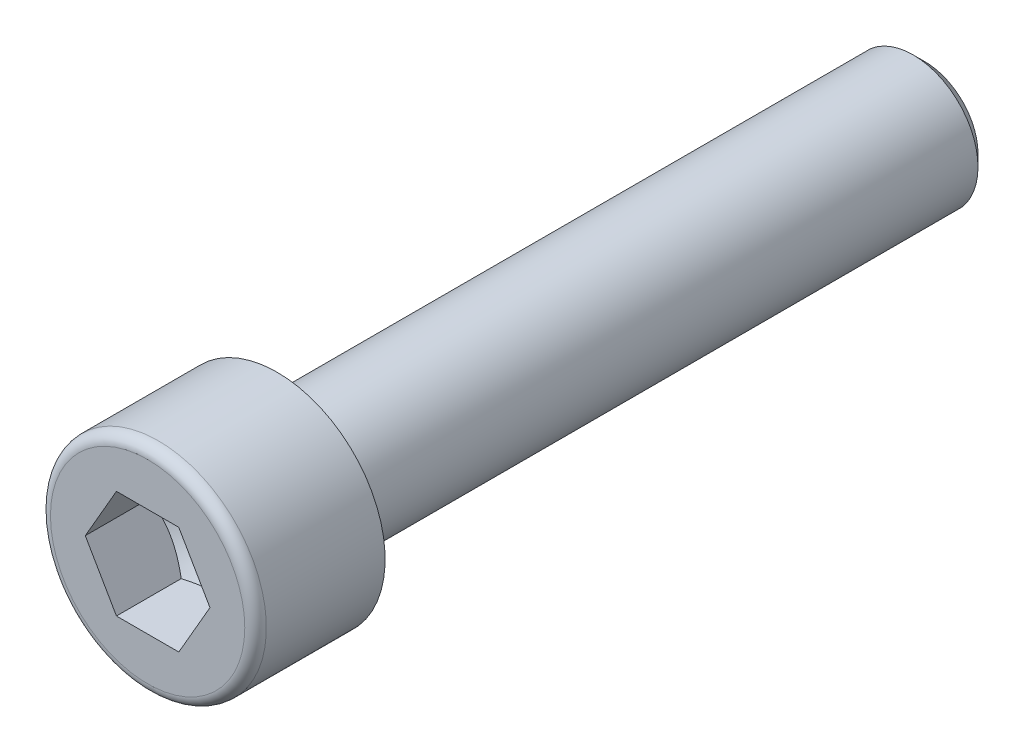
ISO-10303-21;
HEADER;
FILE_DESCRIPTION(('STEP AP214'),'2;1');
FILE_NAME('part.step','',(''),(''),'','','');
FILE_SCHEMA(('AUTOMOTIVE_DESIGN { 1 0 10303 214 1 1 1 1 }'));
ENDSEC;
DATA;
#1=APPLICATION_CONTEXT('core data for automotive mechanical design processes');
#2=APPLICATION_PROTOCOL_DEFINITION('international standard','automotive_design',2000,#1);
#3=PRODUCT_CONTEXT('',#1,'mechanical');
#4=PRODUCT('Part','Part','',(#3));
#5=PRODUCT_RELATED_PRODUCT_CATEGORY('part','',(#4));
#6=PRODUCT_DEFINITION_FORMATION('','',#4);
#7=PRODUCT_DEFINITION_CONTEXT('part definition',#1,'design');
#8=PRODUCT_DEFINITION('design','',#6,#7);
#9=PRODUCT_DEFINITION_SHAPE('','',#8);
#10=(LENGTH_UNIT() NAMED_UNIT(*) SI_UNIT(.MILLI.,.METRE.));
#11=(NAMED_UNIT(*) PLANE_ANGLE_UNIT() SI_UNIT($,.RADIAN.));
#12=(NAMED_UNIT(*) SI_UNIT($,.STERADIAN.) SOLID_ANGLE_UNIT());
#13=UNCERTAINTY_MEASURE_WITH_UNIT(LENGTH_MEASURE(1.E-05),#10,'distance_accuracy_value','');
#14=(GEOMETRIC_REPRESENTATION_CONTEXT(3) GLOBAL_UNCERTAINTY_ASSIGNED_CONTEXT((#13)) GLOBAL_UNIT_ASSIGNED_CONTEXT((#10,
#11,#12)) REPRESENTATION_CONTEXT('',''));
#15=CARTESIAN_POINT('',(0.,0.,0.));
#16=DIRECTION('',(0.,0.,1.));
#17=DIRECTION('',(1.,0.,0.));
#18=AXIS2_PLACEMENT_3D('',#15,#16,#17);
#19=CARTESIAN_POINT('',(0.,0.,3.0100025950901));
#20=DIRECTION('',(0.,0.,1.));
#21=DIRECTION('',(1.,0.,0.));
#22=AXIS2_PLACEMENT_3D('',#19,#20,#21);
#23=CONICAL_SURFACE('',#22,2.90482499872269,1.04719754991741);
#24=CARTESIAN_POINT('',(1.44374999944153,2.5006483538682,3.0000000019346));
#25=CARTESIAN_POINT('',(1.32523244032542,2.50064835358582,2.96578334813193));
#26=CARTESIAN_POINT('',(1.20577730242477,2.50064835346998,2.93445703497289));
#27=CARTESIAN_POINT('',(0.964926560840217,2.50064835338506,2.87909166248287));
#28=CARTESIAN_POINT('',(0.843527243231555,2.5006483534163,2.85506890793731));
#29=CARTESIAN_POINT('',(0.602090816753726,2.50064835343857,2.81643741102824));
#30=CARTESIAN_POINT('',(0.482087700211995,2.50064835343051,2.80162270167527));
#31=CARTESIAN_POINT('',(0.241389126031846,2.50064835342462,2.78173483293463));
#32=CARTESIAN_POINT('',(0.12069456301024,2.50064835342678,2.7766510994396));
#33=CARTESIAN_POINT('',(-0.120694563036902,2.50064835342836,2.77665109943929));
#34=CARTESIAN_POINT('',(-0.241389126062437,2.50064835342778,2.78173483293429));
#35=CARTESIAN_POINT('',(-0.482087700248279,2.50064835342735,2.80162270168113));
#36=CARTESIAN_POINT('',(-0.602090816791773,2.50064835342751,2.8164374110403));
#37=CARTESIAN_POINT('',(-0.843527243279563,2.50064835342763,2.85506890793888));
#38=CARTESIAN_POINT('',(-0.964926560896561,2.5006483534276,2.87909166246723));
#39=CARTESIAN_POINT('',(-1.20577730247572,2.50064835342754,2.93445703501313));
#40=CARTESIAN_POINT('',(-1.32523244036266,2.50064835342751,2.96578334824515));
#41=CARTESIAN_POINT('',(-1.4437499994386,2.50064835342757,3.00000000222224));
#42=B_SPLINE_CURVE_WITH_KNOTS('',3,(#24,#25,#26,#27,#28,#29,#30,#31,#32,#33,#34,#35,#36,#37,#38,
#39,#40,#41),.UNSPECIFIED.,.F.,.F.,(4,2,2,2,2,2,2,2,4),(0.,0.370187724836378,0.741195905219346,
1.10357470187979,1.46555949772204,1.82754429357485,2.18992309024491,2.56093127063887,
2.93111899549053),.UNSPECIFIED.);
#43=CARTESIAN_POINT('',(1.44374999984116,2.50064835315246,3.00000000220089));
#44=VERTEX_POINT('',#43);
#45=CARTESIAN_POINT('',(-1.44374999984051,2.50064835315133,3.00000000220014));
#46=VERTEX_POINT('',#45);
#47=EDGE_CURVE('E254',#44,#46,#42,.T.);
#48=ORIENTED_EDGE('',*,*,#47,.T.);
#49=CARTESIAN_POINT('',(-1.44375000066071,2.50064835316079,3.00000000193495));
#50=CARTESIAN_POINT('',(-1.50719406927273,2.39076000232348,2.9633599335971));
#51=CARTESIAN_POINT('',(-1.57118578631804,2.2799230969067,2.93003770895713));
#52=CARTESIAN_POINT('',(-1.70027719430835,2.05633021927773,2.87187476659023));
#53=CARTESIAN_POINT('',(-1.7653791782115,1.9435702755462,2.84705462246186));
#54=CARTESIAN_POINT('',(-1.89477636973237,1.71944776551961,2.80842027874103));
#55=CARTESIAN_POINT('',(-1.9590516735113,1.60811967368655,2.79434891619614));
#56=CARTESIAN_POINT('',(-2.08790455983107,1.38493992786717,2.77755378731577));
#57=CARTESIAN_POINT('',(-2.15248167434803,1.27308908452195,2.77481610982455));
#58=CARTESIAN_POINT('',(-2.2731370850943,1.06410778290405,2.7805259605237));
#59=CARTESIAN_POINT('',(-2.32923348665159,0.966945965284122,2.78757153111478));
#60=CARTESIAN_POINT('',(-2.44106084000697,0.773255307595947,2.80989733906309));
#61=CARTESIAN_POINT('',(-2.49679140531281,0.676727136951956,2.82518519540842));
#62=CARTESIAN_POINT('',(-2.60884913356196,0.482637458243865,2.86340187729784));
#63=CARTESIAN_POINT('',(-2.66516212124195,0.385100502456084,2.88649262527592));
#64=CARTESIAN_POINT('',(-2.77694843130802,0.191480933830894,2.93889886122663));
#65=CARTESIAN_POINT('',(-2.83242318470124,0.0953958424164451,2.96820204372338));
#66=CARTESIAN_POINT('',(-2.88749999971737,4.89527872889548E-10,3.00000000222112));
#67=B_SPLINE_CURVE_WITH_KNOTS('',3,(#49,#50,#51,#52,#53,#54,#55,#56,#57,#58,#59,#60,#61,#62,#63,
#64,#65,#66),.UNSPECIFIED.,.F.,.F.,(4,2,2,2,2,2,2,2,4),(0.,0.396372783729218,0.793698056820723,
1.18119076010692,1.56820770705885,1.90512867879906,2.24236162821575,2.58707278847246,
2.93110742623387),.UNSPECIFIED.);
#68=CARTESIAN_POINT('',(-2.88749999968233,0.,3.00000000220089));
#69=VERTEX_POINT('',#68);
#70=EDGE_CURVE('E261',#46,#69,#67,.T.);
#71=ORIENTED_EDGE('',*,*,#70,.T.);
#72=CARTESIAN_POINT('',(-2.88750000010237,-7.0396717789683E-10,3.00000000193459));
#73=CARTESIAN_POINT('',(-2.82405593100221,-0.109888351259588,2.96335993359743));
#74=CARTESIAN_POINT('',(-2.76006421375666,-0.220725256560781,2.93003770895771));
#75=CARTESIAN_POINT('',(-2.63097280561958,-0.444318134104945,2.87187476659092));
#76=CARTESIAN_POINT('',(-2.5658708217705,-0.557078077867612,2.8470546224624));
#77=CARTESIAN_POINT('',(-2.4364736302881,-0.781200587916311,2.80842027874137));
#78=CARTESIAN_POINT('',(-2.37219832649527,-0.89252867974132,2.79434891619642));
#79=CARTESIAN_POINT('',(-2.24334544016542,-1.11570842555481,2.77755378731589));
#80=CARTESIAN_POINT('',(-2.17876832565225,-1.22755926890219,2.77481610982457));
#81=CARTESIAN_POINT('',(-2.05811291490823,-1.43654057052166,2.78052596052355));
#82=CARTESIAN_POINT('',(-2.00201651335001,-1.53370238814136,2.78757153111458));
#83=CARTESIAN_POINT('',(-1.89018915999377,-1.72739304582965,2.80989733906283));
#84=CARTESIAN_POINT('',(-1.83445859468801,-1.82392121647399,2.82518519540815));
#85=CARTESIAN_POINT('',(-1.72240086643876,-2.01801089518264,2.86340187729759));
#86=CARTESIAN_POINT('',(-1.6660878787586,-2.11554785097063,2.8864926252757));
#87=CARTESIAN_POINT('',(-1.55430156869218,-2.30916741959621,2.9388988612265));
#88=CARTESIAN_POINT('',(-1.4988268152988,-2.40525251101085,2.96820204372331));
#89=CARTESIAN_POINT('',(-1.44375000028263,-2.50064835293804,3.00000000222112));
#90=B_SPLINE_CURVE_WITH_KNOTS('',3,(#72,#73,#74,#75,#76,#77,#78,#79,#80,#81,#82,#83,#84,#85,#86,
#87,#88,#89),.UNSPECIFIED.,.F.,.F.,(4,2,2,2,2,2,2,2,4),(0.,0.396372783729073,0.793698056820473,
1.18119076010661,1.56820770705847,1.90512867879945,2.24236162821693,2.58707278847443,
2.93110742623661),.UNSPECIFIED.);
#91=CARTESIAN_POINT('',(-1.44374999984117,-2.50064835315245,3.00000000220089));
#92=VERTEX_POINT('',#91);
#93=EDGE_CURVE('E268',#69,#92,#90,.T.);
#94=ORIENTED_EDGE('',*,*,#93,.T.);
#95=CARTESIAN_POINT('',(-1.44374999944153,-2.5006483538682,3.0000000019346));
#96=CARTESIAN_POINT('',(-1.32523244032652,-2.5006483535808,2.96578334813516));
#97=CARTESIAN_POINT('',(-1.20577730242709,-2.50064835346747,2.93445703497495));
#98=CARTESIAN_POINT('',(-0.964926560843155,-2.50064835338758,2.87909166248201));
#99=CARTESIAN_POINT('',(-0.843527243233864,-2.50064835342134,2.8550689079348));
#100=CARTESIAN_POINT('',(-0.602090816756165,-2.50064835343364,2.81643741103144));
#101=CARTESIAN_POINT('',(-0.482087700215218,-2.50064835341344,2.80162270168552));
#102=CARTESIAN_POINT('',(-0.241389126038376,-2.50064835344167,2.78173483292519));
#103=CARTESIAN_POINT('',(-0.120694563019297,-2.50064835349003,2.7766510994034));
#104=CARTESIAN_POINT('',(0.120694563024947,-2.50064835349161,2.77665109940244));
#105=CARTESIAN_POINT('',(0.241389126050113,-2.50064835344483,2.78173483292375));
#106=CARTESIAN_POINT('',(0.482087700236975,-2.50064835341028,2.80162270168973));
#107=CARTESIAN_POINT('',(0.602090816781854,-2.50064835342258,2.81643741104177));
#108=CARTESIAN_POINT('',(0.84352724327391,-2.50064835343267,2.85506890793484));
#109=CARTESIAN_POINT('',(0.964926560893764,-2.50064835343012,2.87909166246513));
#110=CARTESIAN_POINT('',(1.20577730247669,-2.50064835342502,2.93445703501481));
#111=CARTESIAN_POINT('',(1.32523244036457,-2.50064835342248,2.96578334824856));
#112=CARTESIAN_POINT('',(1.44374999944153,-2.50064835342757,3.00000000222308));
#113=B_SPLINE_CURVE_WITH_KNOTS('',3,(#95,#96,#97,#98,#99,#100,#101,#102,#103,#104,#105,#106,
#107,#108,#109,#110,#111,#112),.UNSPECIFIED.,.F.,.F.,(4,2,2,2,2,2,2,2,4),(0.,0.370187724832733,
0.741195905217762,1.10357470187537,1.465559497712,1.82754429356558,2.1899230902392,
2.56093127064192,2.93111899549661),.UNSPECIFIED.);
#114=CARTESIAN_POINT('',(1.44374999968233,-2.50064835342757,3.00000000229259));
#115=VERTEX_POINT('',#114);
#116=EDGE_CURVE('E66',#92,#115,#113,.T.);
#117=ORIENTED_EDGE('',*,*,#116,.T.);
#118=CARTESIAN_POINT('',(1.44375000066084,-2.50064835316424,3.0000000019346));
#119=CARTESIAN_POINT('',(1.5071940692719,-2.39076000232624,2.96335993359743));
#120=CARTESIAN_POINT('',(1.57118578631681,-2.2799230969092,2.93003770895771));
#121=CARTESIAN_POINT('',(1.70027719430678,-2.0563302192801,2.87187476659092));
#122=CARTESIAN_POINT('',(1.76537917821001,-1.9435702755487,2.8470546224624));
#123=CARTESIAN_POINT('',(1.89477636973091,-1.71944776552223,2.80842027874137));
#124=CARTESIAN_POINT('',(1.9590516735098,-1.60811967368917,2.79434891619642));
#125=CARTESIAN_POINT('',(2.08790455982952,-1.38493992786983,2.77755378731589));
#126=CARTESIAN_POINT('',(2.15248167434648,-1.27308908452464,2.77481610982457));
#127=CARTESIAN_POINT('',(2.27313708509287,-1.06410778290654,2.78052596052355));
#128=CARTESIAN_POINT('',(2.32923348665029,-0.966945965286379,2.78757153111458));
#129=CARTESIAN_POINT('',(2.44106084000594,-0.773255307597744,2.80989733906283));
#130=CARTESIAN_POINT('',(2.4967914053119,-0.676727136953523,2.82518519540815));
#131=CARTESIAN_POINT('',(2.60884913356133,-0.482637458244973,2.86340187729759));
#132=CARTESIAN_POINT('',(2.66516212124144,-0.385100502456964,2.8864926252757));
#133=CARTESIAN_POINT('',(2.77694843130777,-0.191480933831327,2.9388988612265));
#134=CARTESIAN_POINT('',(2.83242318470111,-0.0953958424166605,2.96820204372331));
#135=CARTESIAN_POINT('',(2.88749999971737,-4.89529424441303E-10,3.00000000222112));
#136=B_SPLINE_CURVE_WITH_KNOTS('',3,(#118,#119,#120,#121,#122,#123,#124,#125,#126,#127,#128,
#129,#130,#131,#132,#133,#134,#135),.UNSPECIFIED.,.F.,.F.,(4,2,2,2,2,2,2,2,4),(0.,
0.396372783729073,0.793698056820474,1.18119076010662,1.56820770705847,1.90512867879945,
2.24236162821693,2.58707278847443,2.93110742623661),.UNSPECIFIED.);
#137=CARTESIAN_POINT('',(2.88749999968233,0.,3.00000000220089));
#138=VERTEX_POINT('',#137);
#139=EDGE_CURVE('E172',#115,#138,#136,.T.);
#140=ORIENTED_EDGE('',*,*,#139,.T.);
#141=CARTESIAN_POINT('',(2.88750000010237,7.03967324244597E-10,3.0000000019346));
#142=CARTESIAN_POINT('',(2.82405593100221,0.109888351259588,2.96335993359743));
#143=CARTESIAN_POINT('',(2.76006421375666,0.220725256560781,2.93003770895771));
#144=CARTESIAN_POINT('',(2.63097280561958,0.444318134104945,2.87187476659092));
#145=CARTESIAN_POINT('',(2.5658708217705,0.557078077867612,2.8470546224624));
#146=CARTESIAN_POINT('',(2.4364736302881,0.781200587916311,2.80842027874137));
#147=CARTESIAN_POINT('',(2.37219832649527,0.89252867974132,2.79434891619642));
#148=CARTESIAN_POINT('',(2.24334544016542,1.11570842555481,2.77755378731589));
#149=CARTESIAN_POINT('',(2.17876832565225,1.22755926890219,2.77481610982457));
#150=CARTESIAN_POINT('',(2.05811291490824,1.43654057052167,2.78052596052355));
#151=CARTESIAN_POINT('',(2.00201651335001,1.53370238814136,2.78757153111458));
#152=CARTESIAN_POINT('',(1.89018915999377,1.72739304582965,2.80989733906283));
#153=CARTESIAN_POINT('',(1.83445859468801,1.823921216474,2.82518519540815));
#154=CARTESIAN_POINT('',(1.72240086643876,2.01801089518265,2.86340187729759));
#155=CARTESIAN_POINT('',(1.6660878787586,2.11554785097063,2.8864926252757));
#156=CARTESIAN_POINT('',(1.55430156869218,2.30916741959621,2.9388988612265));
#157=CARTESIAN_POINT('',(1.4988268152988,2.40525251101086,2.96820204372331));
#158=CARTESIAN_POINT('',(1.44375000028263,2.50064835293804,3.00000000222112));
#159=B_SPLINE_CURVE_WITH_KNOTS('',3,(#141,#142,#143,#144,#145,#146,#147,#148,#149,#150,#151,
#152,#153,#154,#155,#156,#157,#158),.UNSPECIFIED.,.F.,.F.,(4,2,2,2,2,2,2,2,4),(0.,
0.396372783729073,0.793698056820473,1.18119076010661,1.56820770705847,1.90512867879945,
2.24236162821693,2.58707278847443,2.93110742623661),.UNSPECIFIED.);
#160=EDGE_CURVE('E231',#138,#44,#159,.T.);
#161=ORIENTED_EDGE('',*,*,#160,.T.);
#162=EDGE_LOOP('',(#48,#71,#94,#117,#140,#161));
#163=FACE_BOUND('',#162,.T.);
#164=CARTESIAN_POINT('',(0.,2.8421709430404E-10,1.3329010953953));
#165=VERTEX_POINT('',#164);
#166=VERTEX_LOOP('',#165);
#167=FACE_BOUND('',#166,.T.);
#168=ADVANCED_FACE('F16',(#163,#167),#23,.F.);
#169=CARTESIAN_POINT('',(-1.44375,-2.50064835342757,6.));
#170=DIRECTION('',(0.,-1.,0.));
#171=DIRECTION('',(0.,0.,-1.));
#172=AXIS2_PLACEMENT_3D('',#169,#170,#171);
#173=PLANE('',#172);
#174=ORIENTED_EDGE('',*,*,#116,.F.);
#175=DIRECTION('',(0.,0.,1.));
#176=VECTOR('',#175,1.);
#177=CARTESIAN_POINT('',(-1.44375,-2.50064835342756,6.));
#178=LINE('',#177,#176);
#179=CARTESIAN_POINT('',(-1.44375,-2.50064835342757,6.));
#180=VERTEX_POINT('',#179);
#181=EDGE_CURVE('E273',#92,#180,#178,.T.);
#182=ORIENTED_EDGE('',*,*,#181,.T.);
#183=DIRECTION('',(1.,0.,0.));
#184=VECTOR('',#183,1.);
#185=CARTESIAN_POINT('',(0.,-2.50064835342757,6.));
#186=LINE('',#185,#184);
#187=CARTESIAN_POINT('',(1.44375,-2.50064835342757,6.));
#188=VERTEX_POINT('',#187);
#189=EDGE_CURVE('E163',#188,#180,#186,.F.);
#190=ORIENTED_EDGE('',*,*,#189,.F.);
#191=DIRECTION('',(0.,0.,1.));
#192=VECTOR('',#191,1.);
#193=CARTESIAN_POINT('',(1.44375,-2.50064835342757,6.));
#194=LINE('',#193,#192);
#195=EDGE_CURVE('E230',#188,#115,#194,.F.);
#196=ORIENTED_EDGE('',*,*,#195,.T.);
#197=EDGE_LOOP('',(#174,#182,#190,#196));
#198=FACE_BOUND('',#197,.T.);
#199=ADVANCED_FACE('F71',(#198),#173,.F.);
#200=CARTESIAN_POINT('',(-2.8875,0.,6.));
#201=DIRECTION('',(-0.866025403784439,-0.5,0.));
#202=DIRECTION('',(0.5,-0.866025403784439,0.));
#203=AXIS2_PLACEMENT_3D('',#200,#201,#202);
#204=PLANE('',#203);
#205=DIRECTION('',(0.,0.,1.));
#206=VECTOR('',#205,1.);
#207=CARTESIAN_POINT('',(-2.8875,0.,6.));
#208=LINE('',#207,#206);
#209=CARTESIAN_POINT('',(-2.8875,0.,6.));
#210=VERTEX_POINT('',#209);
#211=EDGE_CURVE('E267',#69,#210,#208,.T.);
#212=ORIENTED_EDGE('',*,*,#211,.T.);
#213=DIRECTION('',(-0.5,0.866025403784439,0.));
#214=VECTOR('',#213,1.);
#215=CARTESIAN_POINT('',(-1.44375,-2.50064835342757,6.));
#216=LINE('',#215,#214);
#217=EDGE_CURVE('E171',#180,#210,#216,.T.);
#218=ORIENTED_EDGE('',*,*,#217,.F.);
#219=ORIENTED_EDGE('',*,*,#181,.F.);
#220=ORIENTED_EDGE('',*,*,#93,.F.);
#221=EDGE_LOOP('',(#212,#218,#219,#220));
#222=FACE_BOUND('',#221,.T.);
#223=ADVANCED_FACE('F77',(#222),#204,.F.);
#224=CARTESIAN_POINT('',(-1.44375,2.50064835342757,6.));
#225=DIRECTION('',(-0.866025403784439,0.5,0.));
#226=DIRECTION('',(-0.5,-0.866025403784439,0.));
#227=AXIS2_PLACEMENT_3D('',#224,#225,#226);
#228=PLANE('',#227);
#229=DIRECTION('',(0.,0.,1.));
#230=VECTOR('',#229,1.);
#231=CARTESIAN_POINT('',(-1.44375,2.50064835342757,6.));
#232=LINE('',#231,#230);
#233=CARTESIAN_POINT('',(-1.44375,2.50064835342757,6.));
#234=VERTEX_POINT('',#233);
#235=EDGE_CURVE('E260',#46,#234,#232,.T.);
#236=ORIENTED_EDGE('',*,*,#235,.T.);
#237=DIRECTION('',(0.5,0.866025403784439,0.));
#238=VECTOR('',#237,1.);
#239=CARTESIAN_POINT('',(-2.8875,0.,6.));
#240=LINE('',#239,#238);
#241=EDGE_CURVE('E189',#210,#234,#240,.T.);
#242=ORIENTED_EDGE('',*,*,#241,.F.);
#243=ORIENTED_EDGE('',*,*,#211,.F.);
#244=ORIENTED_EDGE('',*,*,#70,.F.);
#245=EDGE_LOOP('',(#236,#242,#243,#244));
#246=FACE_BOUND('',#245,.T.);
#247=ADVANCED_FACE('F250',(#246),#228,.F.);
#248=CARTESIAN_POINT('',(1.44375,2.50064835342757,6.));
#249=DIRECTION('',(0.,1.,0.));
#250=DIRECTION('',(0.,0.,1.));
#251=AXIS2_PLACEMENT_3D('',#248,#249,#250);
#252=PLANE('',#251);
#253=ORIENTED_EDGE('',*,*,#47,.F.);
#254=DIRECTION('',(0.,0.,1.));
#255=VECTOR('',#254,1.);
#256=CARTESIAN_POINT('',(1.44375,2.50064835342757,6.));
#257=LINE('',#256,#255);
#258=CARTESIAN_POINT('',(1.44375,2.50064835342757,6.));
#259=VERTEX_POINT('',#258);
#260=EDGE_CURVE('E259',#44,#259,#257,.T.);
#261=ORIENTED_EDGE('',*,*,#260,.T.);
#262=DIRECTION('',(1.,0.,0.));
#263=VECTOR('',#262,1.);
#264=CARTESIAN_POINT('',(0.,2.50064835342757,6.));
#265=LINE('',#264,#263);
#266=EDGE_CURVE('E184',#234,#259,#265,.T.);
#267=ORIENTED_EDGE('',*,*,#266,.F.);
#268=ORIENTED_EDGE('',*,*,#235,.F.);
#269=EDGE_LOOP('',(#253,#261,#267,#268));
#270=FACE_BOUND('',#269,.T.);
#271=ADVANCED_FACE('F245',(#270),#252,.F.);
#272=CARTESIAN_POINT('',(2.8875,0.,6.));
#273=DIRECTION('',(0.866025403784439,0.5,0.));
#274=DIRECTION('',(-0.5,0.866025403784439,0.));
#275=AXIS2_PLACEMENT_3D('',#272,#273,#274);
#276=PLANE('',#275);
#277=DIRECTION('',(0.,0.,1.));
#278=VECTOR('',#277,1.);
#279=CARTESIAN_POINT('',(2.8875,0.,6.));
#280=LINE('',#279,#278);
#281=CARTESIAN_POINT('',(2.8875,0.,6.));
#282=VERTEX_POINT('',#281);
#283=EDGE_CURVE('E307',#138,#282,#280,.T.);
#284=ORIENTED_EDGE('',*,*,#283,.T.);
#285=DIRECTION('',(0.5,-0.866025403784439,0.));
#286=VECTOR('',#285,1.);
#287=CARTESIAN_POINT('',(1.44375,2.50064835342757,6.));
#288=LINE('',#287,#286);
#289=EDGE_CURVE('E179',#259,#282,#288,.T.);
#290=ORIENTED_EDGE('',*,*,#289,.F.);
#291=ORIENTED_EDGE('',*,*,#260,.F.);
#292=ORIENTED_EDGE('',*,*,#160,.F.);
#293=EDGE_LOOP('',(#284,#290,#291,#292));
#294=FACE_BOUND('',#293,.T.);
#295=ADVANCED_FACE('F240',(#294),#276,.F.);
#296=CARTESIAN_POINT('',(1.44375,-2.50064835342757,6.));
#297=DIRECTION('',(0.866025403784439,-0.5,0.));
#298=DIRECTION('',(0.5,0.866025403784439,0.));
#299=AXIS2_PLACEMENT_3D('',#296,#297,#298);
#300=PLANE('',#299);
#301=ORIENTED_EDGE('',*,*,#195,.F.);
#302=DIRECTION('',(-0.5,-0.866025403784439,0.));
#303=VECTOR('',#302,1.);
#304=CARTESIAN_POINT('',(2.8875,0.,6.));
#305=LINE('',#304,#303);
#306=EDGE_CURVE('E175',#282,#188,#305,.T.);
#307=ORIENTED_EDGE('',*,*,#306,.F.);
#308=ORIENTED_EDGE('',*,*,#283,.F.);
#309=ORIENTED_EDGE('',*,*,#139,.F.);
#310=EDGE_LOOP('',(#301,#307,#308,#309));
#311=FACE_BOUND('',#310,.T.);
#312=ADVANCED_FACE('F237',(#311),#300,.F.);
#313=CARTESIAN_POINT('',(0.,2.25,6.));
#314=DIRECTION('',(0.,0.,1.));
#315=DIRECTION('',(1.,0.,0.));
#316=AXIS2_PLACEMENT_3D('',#313,#314,#315);
#317=PLANE('',#316);
#318=ORIENTED_EDGE('',*,*,#289,.T.);
#319=ORIENTED_EDGE('',*,*,#306,.T.);
#320=ORIENTED_EDGE('',*,*,#189,.T.);
#321=ORIENTED_EDGE('',*,*,#217,.T.);
#322=ORIENTED_EDGE('',*,*,#241,.T.);
#323=ORIENTED_EDGE('',*,*,#266,.T.);
#324=EDGE_LOOP('',(#318,#319,#320,#321,#322,#323));
#325=FACE_BOUND('',#324,.T.);
#326=CARTESIAN_POINT('',(0.,0.,6.));
#327=DIRECTION('',(0.,0.,-1.));
#328=DIRECTION('',(-1.,0.,0.));
#329=AXIS2_PLACEMENT_3D('',#326,#327,#328);
#330=CIRCLE('',#329,4.5);
#331=CARTESIAN_POINT('',(-4.5,0.,6.));
#332=VERTEX_POINT('',#331);
#333=CARTESIAN_POINT('',(0.,4.5,6.));
#334=VERTEX_POINT('',#333);
#335=EDGE_CURVE('E159',#332,#334,#330,.T.);
#336=ORIENTED_EDGE('',*,*,#335,.F.);
#337=CARTESIAN_POINT('',(0.,0.,6.));
#338=DIRECTION('',(0.,0.,-1.));
#339=DIRECTION('',(1.,0.,0.));
#340=AXIS2_PLACEMENT_3D('',#337,#338,#339);
#341=CIRCLE('',#340,4.5);
#342=CARTESIAN_POINT('',(4.5,0.,6.));
#343=VERTEX_POINT('',#342);
#344=EDGE_CURVE('E178',#343,#332,#341,.T.);
#345=ORIENTED_EDGE('',*,*,#344,.F.);
#346=CARTESIAN_POINT('',(0.,0.,6.));
#347=DIRECTION('',(0.,0.,-1.));
#348=DIRECTION('',(0.,1.,0.));
#349=AXIS2_PLACEMENT_3D('',#346,#347,#348);
#350=CIRCLE('',#349,4.5);
#351=EDGE_CURVE('E143',#334,#343,#350,.T.);
#352=ORIENTED_EDGE('',*,*,#351,.F.);
#353=EDGE_LOOP('',(#336,#345,#352));
#354=FACE_BOUND('',#353,.T.);
#355=ADVANCED_FACE('F119',(#325,#354),#317,.T.);
#356=CARTESIAN_POINT('',(0.,0.,5.5));
#357=DIRECTION('',(0.,0.,-1.));
#358=DIRECTION('',(-1.,0.,0.));
#359=AXIS2_PLACEMENT_3D('',#356,#357,#358);
#360=TOROIDAL_SURFACE('',#359,4.5,0.5);
#361=ORIENTED_EDGE('',*,*,#344,.T.);
#362=ORIENTED_EDGE('',*,*,#335,.T.);
#363=ORIENTED_EDGE('',*,*,#351,.T.);
#364=EDGE_LOOP('',(#361,#362,#363));
#365=FACE_BOUND('',#364,.T.);
#366=CARTESIAN_POINT('',(0.,0.,5.5));
#367=DIRECTION('',(0.,0.,-1.));
#368=DIRECTION('',(-1.,0.,0.));
#369=AXIS2_PLACEMENT_3D('',#366,#367,#368);
#370=CIRCLE('',#369,5.);
#371=CARTESIAN_POINT('',(-5.,0.,5.5));
#372=VERTEX_POINT('',#371);
#373=EDGE_CURVE('E139',#372,#372,#370,.T.);
#374=ORIENTED_EDGE('',*,*,#373,.F.);
#375=EDGE_LOOP('',(#374));
#376=FACE_BOUND('',#375,.T.);
#377=ADVANCED_FACE('F113',(#365,#376),#360,.T.);
#378=CARTESIAN_POINT('',(0.,0.,2.75));
#379=DIRECTION('',(0.,0.,-1.));
#380=DIRECTION('',(-1.,0.,0.));
#381=AXIS2_PLACEMENT_3D('',#378,#379,#380);
#382=CYLINDRICAL_SURFACE('',#381,5.);
#383=CARTESIAN_POINT('',(0.,0.,0.));
#384=DIRECTION('',(0.,0.,-1.));
#385=DIRECTION('',(-1.,0.,0.));
#386=AXIS2_PLACEMENT_3D('',#383,#384,#385);
#387=CIRCLE('',#386,5.);
#388=CARTESIAN_POINT('',(-5.,0.,0.));
#389=VERTEX_POINT('',#388);
#390=EDGE_CURVE('E142',#389,#389,#387,.T.);
#391=ORIENTED_EDGE('',*,*,#390,.F.);
#392=EDGE_LOOP('',(#391));
#393=FACE_BOUND('',#392,.T.);
#394=ORIENTED_EDGE('',*,*,#373,.T.);
#395=EDGE_LOOP('',(#394));
#396=FACE_BOUND('',#395,.T.);
#397=ADVANCED_FACE('F111',(#393,#396),#382,.T.);
#398=CARTESIAN_POINT('',(0.,4.15,0.));
#399=DIRECTION('',(0.,0.,-1.));
#400=DIRECTION('',(-1.,0.,0.));
#401=AXIS2_PLACEMENT_3D('',#398,#399,#400);
#402=PLANE('',#401);
#403=CARTESIAN_POINT('',(-3.3,0.,0.));
#404=CARTESIAN_POINT('',(-3.29999466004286,0.0345274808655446,-1.00419282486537E-11));
#405=CARTESIAN_POINT('',(-3.29944774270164,0.069054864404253,-1.53321174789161E-10));
#406=CARTESIAN_POINT('',(-3.29727212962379,0.138075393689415,-5.51848963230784E-10));
#407=CARTESIAN_POINT('',(-3.29564343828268,0.172568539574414,-8.07097050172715E-10));
#408=CARTESIAN_POINT('',(-3.2913056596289,0.241486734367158,-1.27506106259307E-09));
#409=CARTESIAN_POINT('',(-3.28859657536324,0.275911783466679,-1.48777710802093E-09));
#410=CARTESIAN_POINT('',(-3.28210073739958,0.344659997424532,-1.78713023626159E-09));
#411=CARTESIAN_POINT('',(-3.27831398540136,0.378983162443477,-1.87376751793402E-09));
#412=CARTESIAN_POINT('',(-3.26966651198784,0.447493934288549,-1.88925156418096E-09));
#413=CARTESIAN_POINT('',(-3.26480579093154,0.481681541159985,-1.81809838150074E-09));
#414=CARTESIAN_POINT('',(-3.25401517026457,0.54988759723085,-1.54365258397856E-09));
#415=CARTESIAN_POINT('',(-3.24808526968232,0.583906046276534,-1.34035984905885E-09));
#416=CARTESIAN_POINT('',(-3.2351620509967,0.651740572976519,-8.81657257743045E-10));
#417=CARTESIAN_POINT('',(-3.22816873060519,0.685556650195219,-6.26247289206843E-10));
#418=CARTESIAN_POINT('',(-3.21312574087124,0.752952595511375,-2.04140378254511E-10));
#419=CARTESIAN_POINT('',(-3.20507606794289,0.786532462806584,-3.74437369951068E-11));
#420=CARTESIAN_POINT('',(-3.1837634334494,0.869668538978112,4.4331600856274E-11));
#421=CARTESIAN_POINT('',(-3.16986720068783,0.919063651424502,-2.02104251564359E-10));
#422=CARTESIAN_POINT('',(-3.13978951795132,1.01715495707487,-2.21158546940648E-09));
#423=CARTESIAN_POINT('',(-3.12360804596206,1.06585114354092,-3.97464544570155E-09));
#424=CARTESIAN_POINT('',(-3.09982838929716,1.13220677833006,-8.04463308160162E-09));
#425=CARTESIAN_POINT('',(-3.0931964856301,1.15021674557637,-9.32060204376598E-09));
#426=CARTESIAN_POINT('',(-3.07961928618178,1.18611841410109,-1.21038442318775E-08));
#427=CARTESIAN_POINT('',(-3.07267398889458,1.20401011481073,-1.36111185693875E-08));
#428=CARTESIAN_POINT('',(-3.05176584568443,1.25650880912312,-1.84083323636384E-08));
#429=CARTESIAN_POINT('',(-3.03737001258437,1.29094445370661,-2.20375071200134E-08));
#430=CARTESIAN_POINT('',(-3.00741856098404,1.35930717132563,-3.01251664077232E-08));
#431=CARTESIAN_POINT('',(-2.99186293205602,1.39323423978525,-3.45836583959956E-08));
#432=CARTESIAN_POINT('',(-2.95960946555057,1.4605416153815,-4.42612309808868E-08));
#433=CARTESIAN_POINT('',(-2.94291161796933,1.49392191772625,-4.94803182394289E-08));
#434=CARTESIAN_POINT('',(-2.90839300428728,1.56009707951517,-6.06063017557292E-08));
#435=CARTESIAN_POINT('',(-2.89057222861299,1.59289193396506,-6.65132038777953E-08));
#436=CARTESIAN_POINT('',(-2.85382823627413,1.6578584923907,-7.89456172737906E-08));
#437=CARTESIAN_POINT('',(-2.83490501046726,1.69003019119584,-8.54711336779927E-08));
#438=CARTESIAN_POINT('',(-2.7959778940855,1.75371336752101,-9.90731102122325E-08));
#439=CARTESIAN_POINT('',(-2.77597399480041,1.7852248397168,-1.06149574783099E-07));
#440=CARTESIAN_POINT('',(-2.73490854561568,1.84755127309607,-1.20787860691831E-07));
#441=CARTESIAN_POINT('',(-2.7138469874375,1.87836622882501,-1.28349685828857E-07));
#442=CARTESIAN_POINT('',(-2.67069045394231,1.93926413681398,-1.43895052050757E-07));
#443=CARTESIAN_POINT('',(-2.64859547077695,1.96934708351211,-1.51878596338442E-07));
#444=CARTESIAN_POINT('',(-2.60339751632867,2.02874632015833,-1.68205692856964E-07));
#445=CARTESIAN_POINT('',(-2.58029453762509,2.05806260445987,-1.7654924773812E-07));
#446=CARTESIAN_POINT('',(-2.53310716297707,2.11589476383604,-1.93536775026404E-07));
#447=CARTESIAN_POINT('',(-2.50902276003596,2.144410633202,-2.02180749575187E-07));
#448=CARTESIAN_POINT('',(-2.45990031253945,2.20060906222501,-2.19710917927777E-07));
#449=CARTESIAN_POINT('',(-2.43486226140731,2.22829161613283,-2.28597113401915E-07));
#450=CARTESIAN_POINT('',(-2.38386111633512,2.28279173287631,-2.46557634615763E-07));
#451=CARTESIAN_POINT('',(-2.35789801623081,2.30960928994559,-2.55631961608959E-07));
#452=CARTESIAN_POINT('',(-2.30885009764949,2.358580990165,-2.72603239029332E-07));
#453=CARTESIAN_POINT('',(-2.28588388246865,2.38085408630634,-2.80483218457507E-07));
#454=CARTESIAN_POINT('',(-2.23931325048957,2.42472325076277,-2.96322332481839E-07));
#455=CARTESIAN_POINT('',(-2.21570883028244,2.44631931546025,-3.04281467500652E-07));
#456=CARTESIAN_POINT('',(-2.16788179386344,2.48881600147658,-3.20180099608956E-07));
#457=CARTESIAN_POINT('',(-2.14365917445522,2.50971661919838,-3.28119596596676E-07));
#458=CARTESIAN_POINT('',(-2.0946165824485,2.55080467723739,-3.44198953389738E-07));
#459=CARTESIAN_POINT('',(-2.06979660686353,2.57099211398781,-3.52338814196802E-07));
#460=CARTESIAN_POINT('',(-2.01263642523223,2.61611778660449,-3.69998887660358E-07));
#461=CARTESIAN_POINT('',(-1.98011439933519,2.64082626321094,-3.79278466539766E-07));
#462=CARTESIAN_POINT('',(-1.91417499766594,2.68901759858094,-3.95107298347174E-07));
#463=CARTESIAN_POINT('',(-1.88075761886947,2.71250045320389,-4.0165654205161E-07));
#464=CARTESIAN_POINT('',(-1.81307344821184,2.75820858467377,-4.12140769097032E-07));
#465=CARTESIAN_POINT('',(-1.77880665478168,2.78043385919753,-4.16075747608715E-07));
#466=CARTESIAN_POINT('',(-1.70947079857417,2.82359612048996,-4.21126305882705E-07));
#467=CARTESIAN_POINT('',(-1.67440173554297,2.84453310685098,-4.22241884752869E-07));
#468=CARTESIAN_POINT('',(-1.60794118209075,2.88255477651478,-4.21681752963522E-07));
#469=CARTESIAN_POINT('',(-1.57663789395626,2.89979387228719,-4.20337495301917E-07));
#470=CARTESIAN_POINT('',(-1.51348733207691,2.93324538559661,-4.15510124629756E-07));
#471=CARTESIAN_POINT('',(-1.48164005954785,2.94945780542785,-4.12027016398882E-07));
#472=CARTESIAN_POINT('',(-1.41743545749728,2.98083867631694,-4.03004052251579E-07));
#473=CARTESIAN_POINT('',(-1.38507812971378,2.99600713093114,-3.97464203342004E-07));
#474=CARTESIAN_POINT('',(-1.31988760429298,3.02528406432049,-3.84458452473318E-07));
#475=CARTESIAN_POINT('',(-1.28705440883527,3.03939254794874,-3.76992559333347E-07));
#476=CARTESIAN_POINT('',(-1.220946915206,3.06653460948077,-3.60315783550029E-07));
#477=CARTESIAN_POINT('',(-1.18767261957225,3.07956819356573,-3.51104910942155E-07));
#478=CARTESIAN_POINT('',(-1.12071813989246,3.10454667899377,-3.3116913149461E-07));
#479=CARTESIAN_POINT('',(-1.08703795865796,3.11649158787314,-3.20444235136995E-07));
#480=CARTESIAN_POINT('',(-1.01930735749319,3.13928009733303,-2.9776138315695E-07));
#481=CARTESIAN_POINT('',(-0.985256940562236,3.15012370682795,-2.85803437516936E-07));
#482=CARTESIAN_POINT('',(-0.916821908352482,3.17069816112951,-2.60985448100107E-07));
#483=CARTESIAN_POINT('',(-0.882437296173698,3.18042901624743,-2.48125412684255E-07));
#484=CARTESIAN_POINT('',(-0.813370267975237,3.19876768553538,-2.21884198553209E-07));
#485=CARTESIAN_POINT('',(-0.778687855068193,3.20737551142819,-2.08503025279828E-07));
#486=CARTESIAN_POINT('',(-0.709061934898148,3.22345903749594,-1.81650488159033E-07));
#487=CARTESIAN_POINT('',(-0.67411843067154,3.23093475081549,-1.68179125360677E-07));
#488=CARTESIAN_POINT('',(-0.604007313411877,3.24474616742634,-1.4162713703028E-07));
#489=CARTESIAN_POINT('',(-0.568839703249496,3.25108188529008,-1.28546506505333E-07));
#490=CARTESIAN_POINT('',(-0.498317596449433,3.26260663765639,-1.03306973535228E-07));
#491=CARTESIAN_POINT('',(-0.462963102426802,3.26779568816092,-9.1148058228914E-08));
#492=CARTESIAN_POINT('',(-0.392104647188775,3.27702164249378,-6.83326821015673E-08));
#493=CARTESIAN_POINT('',(-0.356600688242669,3.28105856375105,-5.76761985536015E-08));
#494=CARTESIAN_POINT('',(-0.285480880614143,3.28797604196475,-3.84973703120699E-08));
#495=CARTESIAN_POINT('',(-0.249865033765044,3.29085661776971,-2.99749908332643E-08));
#496=CARTESIAN_POINT('',(-0.178559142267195,3.29545832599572,-1.57424525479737E-08));
#497=CARTESIAN_POINT('',(-0.142869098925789,3.29717947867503,-1.00322446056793E-08));
#498=CARTESIAN_POINT('',(-0.0714525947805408,3.29946081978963,-2.16554824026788E-09));
#499=CARTESIAN_POINT('',(-0.0357261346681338,3.30002102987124,-8.99355774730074E-12));
#500=CARTESIAN_POINT('',(0.,3.3,0.));
#501=B_SPLINE_CURVE_WITH_KNOTS('',3,(#403,#404,#405,#406,#407,#408,#409,#410,#411,#412,#413,
#414,#415,#416,#417,#418,#419,#420,#421,#422,#423,#424,#425,#426,#427,#428,#429,#430,#431,#432,
#433,#434,#435,#436,#437,#438,#439,#440,#441,#442,#443,#444,#445,#446,#447,#448,#449,#450,#451,
#452,#453,#454,#455,#456,#457,#458,#459,#460,#461,#462,#463,#464,#465,#466,#467,#468,#469,#470,
#471,#472,#473,#474,#475,#476,#477,#478,#479,#480,#481,#482,#483,#484,#485,#486,#487,#488,#489,
#490,#491,#492,#493,#494,#495,#496,#497,#498,#499,#500),.UNSPECIFIED.,.F.,.F.,(4,2,2,2,2,2,2,2,
2,2,2,2,2,2,2,2,2,2,2,2,2,2,2,2,2,2,2,2,2,2,2,2,2,2,2,2,2,2,2,2,2,2,2,2,2,2,2,2,4),(0.,
0.103578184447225,0.20715594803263,0.310733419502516,0.414310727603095,0.51788800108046,
0.621465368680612,0.725042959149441,0.828620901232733,0.982501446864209,1.13638347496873,
1.19395791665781,1.25153263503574,1.363480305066,1.47542898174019,1.58737863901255,
1.69932925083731,1.81128079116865,1.92323323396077,2.03518655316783,2.14714072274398,
2.25909571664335,2.37105150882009,2.48300807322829,2.59496538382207,2.69093058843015,
2.78689630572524,2.88286251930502,2.97882921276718,3.10133040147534,3.22383200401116,
3.34633383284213,3.46883570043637,3.57602616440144,3.68321638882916,3.79040624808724,
3.89759561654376,4.00478436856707,4.11197237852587,4.21915952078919,4.32634566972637,
4.43353069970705,4.54071448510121,4.64789690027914,4.75507781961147,4.86225711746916,
4.96943466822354,5.07661034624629,5.18378402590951),.UNSPECIFIED.);
#502=CARTESIAN_POINT('',(-3.3,0.,0.));
#503=VERTEX_POINT('',#502);
#504=CARTESIAN_POINT('',(3.55657589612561E-07,3.29999999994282,0.));
#505=VERTEX_POINT('',#504);
#506=EDGE_CURVE('E200',#503,#505,#501,.T.);
#507=ORIENTED_EDGE('',*,*,#506,.F.);
#508=CARTESIAN_POINT('',(0.,0.,0.));
#509=DIRECTION('',(0.,0.,-1.));
#510=DIRECTION('',(0.,1.,0.));
#511=AXIS2_PLACEMENT_3D('',#508,#509,#510);
#512=CIRCLE('',#511,3.3);
#513=CARTESIAN_POINT('',(3.29999999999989,0.,0.));
#514=VERTEX_POINT('',#513);
#515=EDGE_CURVE('E203',#514,#503,#512,.T.);
#516=ORIENTED_EDGE('',*,*,#515,.F.);
#517=CARTESIAN_POINT('',(0.,3.3,0.));
#518=CARTESIAN_POINT('',(0.0345274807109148,3.29999464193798,-1.00905025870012E-11));
#519=CARTESIAN_POINT('',(0.0690548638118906,3.299447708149,-1.543258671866E-10));
#520=CARTESIAN_POINT('',(0.138075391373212,3.29727206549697,-5.55638712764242E-10));
#521=CARTESIAN_POINT('',(0.172568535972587,3.29564336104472,-8.12715733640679E-10));
#522=CARTESIAN_POINT('',(0.241486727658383,3.29130555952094,-1.28426818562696E-09));
#523=CARTESIAN_POINT('',(0.275911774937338,3.28859646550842,-1.49874373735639E-09));
#524=CARTESIAN_POINT('',(0.344659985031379,3.28210061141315,-1.80094770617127E-09));
#525=CARTESIAN_POINT('',(0.378983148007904,3.27831385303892,-1.88867632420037E-09));
#526=CARTESIAN_POINT('',(0.447493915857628,3.26966637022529,-1.90532687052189E-09));
#527=CARTESIAN_POINT('',(0.48168152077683,3.26480564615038,-1.8342488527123E-09));
#528=CARTESIAN_POINT('',(0.549887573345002,3.25401502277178,-1.55886656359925E-09));
#529=CARTESIAN_POINT('',(0.583906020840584,3.24808512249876,-1.35456217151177E-09));
#530=CARTESIAN_POINT('',(0.651740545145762,3.23516190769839,-8.92943332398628E-10));
#531=CARTESIAN_POINT('',(0.685556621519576,3.22816859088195,-6.35628771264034E-10));
#532=CARTESIAN_POINT('',(0.752952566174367,3.2131256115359,-2.09302592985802E-10));
#533=CARTESIAN_POINT('',(0.786532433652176,3.20507594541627,-4.02912759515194E-11));
#534=CARTESIAN_POINT('',(0.8696685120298,3.18376333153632,4.68945485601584E-11));
#535=CARTESIAN_POINT('',(0.919063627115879,3.1698671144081,-1.96612070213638E-10));
#536=CARTESIAN_POINT('',(1.0171549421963,3.13978947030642,-2.20457854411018E-09));
#537=CARTESIAN_POINT('',(1.06585113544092,3.12360802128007,-3.9690530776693E-09));
#538=CARTESIAN_POINT('',(1.1322067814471,3.09982839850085,-8.04672545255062E-09));
#539=CARTESIAN_POINT('',(1.15021675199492,3.09319650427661,-9.3253716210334E-09));
#540=CARTESIAN_POINT('',(1.18611842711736,3.07961932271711,-1.21147077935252E-08));
#541=CARTESIAN_POINT('',(1.20401013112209,3.07267403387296,-1.36253989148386E-08));
#542=CARTESIAN_POINT('',(1.25650883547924,3.05176591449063,-1.84337039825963E-08));
#543=CARTESIAN_POINT('',(1.29094448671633,3.03737009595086,-2.20715268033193E-08));
#544=CARTESIAN_POINT('',(1.35930721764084,3.00741867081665,-3.01782459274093E-08));
#545=CARTESIAN_POINT('',(1.3932342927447,2.99186305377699,-3.46471497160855E-08));
#546=CARTESIAN_POINT('',(1.46054168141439,2.95960960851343,-4.43465381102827E-08));
#547=CARTESIAN_POINT('',(1.49392199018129,2.94291177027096,-4.95770293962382E-08));
#548=CARTESIAN_POINT('',(1.5600971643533,2.90839317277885,-6.07260579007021E-08));
#549=CARTESIAN_POINT('',(1.59289202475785,2.89057240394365,-6.66446009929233E-08));
#550=CARTESIAN_POINT('',(1.65785859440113,2.85382842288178,-7.9099820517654E-08));
#551=CARTESIAN_POINT('',(1.69003029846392,2.83490520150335,-8.56365020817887E-08));
#552=CARTESIAN_POINT('',(1.75371348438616,2.79597809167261,-9.92596550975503E-08));
#553=CARTESIAN_POINT('',(1.78522496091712,2.77597419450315,-1.0634613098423E-07));
#554=CARTESIAN_POINT('',(1.84755140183,2.73490874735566,-1.2100264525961E-07));
#555=CARTESIAN_POINT('',(1.87836636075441,2.71384718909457,-1.28572687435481E-07));
#556=CARTESIAN_POINT('',(1.93926427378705,2.67069065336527,-1.44132089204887E-07));
#557=CARTESIAN_POINT('',(1.96934722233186,2.64859566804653,-1.52121451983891E-07));
#558=CARTESIAN_POINT('',(2.02874646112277,2.60339770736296,-1.68457219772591E-07));
#559=CARTESIAN_POINT('',(2.05806274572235,2.58029472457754,-1.76803627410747E-07));
#560=CARTESIAN_POINT('',(2.11589490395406,2.53310733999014,-1.93793363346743E-07));
#561=CARTESIAN_POINT('',(2.14441077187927,2.50902293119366,-2.02436693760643E-07));
#562=CARTESIAN_POINT('',(2.20060919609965,2.45990047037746,-2.19961584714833E-07));
#563=CARTESIAN_POINT('',(2.22829174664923,2.43486241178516,-2.28843146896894E-07));
#564=CARTESIAN_POINT('',(2.28279185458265,2.38386125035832,-2.46789948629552E-07));
#565=CARTESIAN_POINT('',(2.3096094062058,2.35789814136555,-2.55855189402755E-07));
#566=CARTESIAN_POINT('',(2.35858109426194,2.30885020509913,-2.72805089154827E-07));
#567=CARTESIAN_POINT('',(2.3808541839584,2.28588398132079,-2.80673420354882E-07));
#568=CARTESIAN_POINT('',(2.42472333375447,2.23931333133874,-2.96485364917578E-07));
#569=CARTESIAN_POINT('',(2.44631939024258,2.21570890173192,-3.04428978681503E-07));
#570=CARTESIAN_POINT('',(2.48881605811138,2.16788184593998,-3.20292725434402E-07));
#571=CARTESIAN_POINT('',(2.5097166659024,2.14365921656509,-3.28212858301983E-07));
#572=CARTESIAN_POINT('',(2.55080470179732,2.09461660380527,-3.44248491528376E-07));
#573=CARTESIAN_POINT('',(2.57099212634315,2.06979661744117,-3.52363992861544E-07));
#574=CARTESIAN_POINT('',(2.61611776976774,2.01263641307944,-3.69966747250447E-07));
#575=CARTESIAN_POINT('',(2.64082622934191,1.9801143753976,-3.7921285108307E-07));
#576=CARTESIAN_POINT('',(2.68901753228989,1.91417495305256,-3.9497801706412E-07));
#577=CARTESIAN_POINT('',(2.71250037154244,1.88075756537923,-4.01497070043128E-07));
#578=CARTESIAN_POINT('',(2.75820847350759,1.813073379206,-4.11924176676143E-07));
#579=CARTESIAN_POINT('',(2.78043373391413,1.77880657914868,-4.15832225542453E-07));
#580=CARTESIAN_POINT('',(2.82359596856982,1.7094707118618,-4.20833460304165E-07));
#581=CARTESIAN_POINT('',(2.84453294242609,1.67440164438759,-4.21926645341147E-07));
#582=CARTESIAN_POINT('',(2.88255459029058,1.60794108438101,-4.21329355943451E-07));
#583=CARTESIAN_POINT('',(2.89979367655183,1.57663779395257,-4.19969730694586E-07));
#584=CARTESIAN_POINT('',(2.93324517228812,1.51348722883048,-4.15115910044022E-07));
#585=CARTESIAN_POINT('',(2.94945758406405,1.48163995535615,-4.11621719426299E-07));
#586=CARTESIAN_POINT('',(2.98083844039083,1.41743535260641,-4.02581053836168E-07));
#587=CARTESIAN_POINT('',(2.99600688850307,1.38507802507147,-3.97034585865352E-07));
#588=CARTESIAN_POINT('',(3.02528381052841,1.31988750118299,-3.84020102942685E-07));
#589=CARTESIAN_POINT('',(3.03939228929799,1.28705430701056,-3.76552096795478E-07));
#590=CARTESIAN_POINT('',(3.06653434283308,1.22094681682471,-3.59875501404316E-07));
#591=CARTESIAN_POINT('',(3.07956792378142,1.1876725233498,-3.50666922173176E-07));
#592=CARTESIAN_POINT('',(3.10454640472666,1.12071804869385,-3.3073989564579E-07));
#593=CARTESIAN_POINT('',(3.11649131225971,1.08703787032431,-3.20021458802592E-07));
#594=CARTESIAN_POINT('',(3.13927982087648,1.01930727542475,-2.9735531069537E-07));
#595=CARTESIAN_POINT('',(3.15012343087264,0.985256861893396,-2.85407609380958E-07));
#596=CARTESIAN_POINT('',(3.17069788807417,0.916821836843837,-2.60613371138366E-07));
#597=CARTESIAN_POINT('',(3.18042874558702,0.882437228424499,-2.47766842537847E-07));
#598=CARTESIAN_POINT('',(3.19876742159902,0.81337020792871,-2.21555241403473E-07));
#599=CARTESIAN_POINT('',(3.20737525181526,0.778687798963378,-2.08190174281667E-07));
#600=CARTESIAN_POINT('',(3.22345878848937,0.709061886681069,-1.81371644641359E-07));
#601=CARTESIAN_POINT('',(3.23093450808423,0.674118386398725,-1.67918183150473E-07));
#602=CARTESIAN_POINT('',(3.24474593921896,0.604007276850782,-1.41402847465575E-07));
#603=CARTESIAN_POINT('',(3.25108166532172,0.568839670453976,-1.28340968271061E-07));
#604=CARTESIAN_POINT('',(3.26260643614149,0.498317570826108,-1.03138701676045E-07));
#605=CARTESIAN_POINT('',(3.26779549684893,0.46296308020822,-9.09983014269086E-08));
#606=CARTESIAN_POINT('',(3.27702147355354,0.392104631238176,-6.82184927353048E-08));
#607=CARTESIAN_POINT('',(3.28105840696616,0.356600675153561,-5.75790616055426E-08));
#608=CARTESIAN_POINT('',(3.28797591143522,0.285480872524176,-3.84315052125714E-08));
#609=CARTESIAN_POINT('',(3.29085650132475,0.249865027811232,-2.99233452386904E-08));
#610=CARTESIAN_POINT('',(3.29545823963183,0.178559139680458,-1.57149120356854E-08));
#611=CARTESIAN_POINT('',(3.29717940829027,0.142869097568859,-1.00145897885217E-08));
#612=CARTESIAN_POINT('',(3.29946078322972,0.0714525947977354,-2.16165098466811E-09));
#613=CARTESIAN_POINT('',(3.30002101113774,0.0357261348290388,-8.9683396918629E-12));
#614=CARTESIAN_POINT('',(3.3,0.,0.));
#615=B_SPLINE_CURVE_WITH_KNOTS('',3,(#517,#518,#519,#520,#521,#522,#523,#524,#525,#526,#527,
#528,#529,#530,#531,#532,#533,#534,#535,#536,#537,#538,#539,#540,#541,#542,#543,#544,#545,#546,
#547,#548,#549,#550,#551,#552,#553,#554,#555,#556,#557,#558,#559,#560,#561,#562,#563,#564,#565,
#566,#567,#568,#569,#570,#571,#572,#573,#574,#575,#576,#577,#578,#579,#580,#581,#582,#583,#584,
#585,#586,#587,#588,#589,#590,#591,#592,#593,#594,#595,#596,#597,#598,#599,#600,#601,#602,#603,
#604,#605,#606,#607,#608,#609,#610,#611,#612,#613,#614),.UNSPECIFIED.,.F.,.F.,(4,2,2,2,2,2,2,2,
2,2,2,2,2,2,2,2,2,2,2,2,2,2,2,2,2,2,2,2,2,2,2,2,2,2,2,2,2,2,2,2,2,2,2,2,2,2,2,2,4),(0.,
0.103578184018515,0.207155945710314,0.310733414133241,0.414310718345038,0.51788798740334,
0.62146535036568,0.725042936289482,0.828620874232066,0.982501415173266,1.1363834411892,
1.19395788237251,1.25153260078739,1.36348027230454,1.47542895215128,1.58737861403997,
1.69932923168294,1.8112807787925,1.92323322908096,2.03518655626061,2.14714073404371,
2.25909573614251,2.37105153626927,2.48300810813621,2.59496542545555,2.69093063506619,
2.78689635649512,2.88286257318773,2.97882926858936,3.10133045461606,3.22383205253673,
3.34633387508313,3.46883573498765,3.57602619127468,3.68321640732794,3.7904062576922,
3.89759561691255,4.00478435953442,4.11197236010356,4.21915949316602,4.32634563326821,
4.43353065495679,4.54071443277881,4.64789684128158,4.75507775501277,4.86225704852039,
4.96943459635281,5.07661027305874,5.18378395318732),.UNSPECIFIED.);
#616=EDGE_CURVE('E38',#505,#514,#615,.T.);
#617=ORIENTED_EDGE('',*,*,#616,.F.);
#618=EDGE_LOOP('',(#507,#516,#617));
#619=FACE_BOUND('',#618,.T.);
#620=ORIENTED_EDGE('',*,*,#390,.T.);
#621=EDGE_LOOP('',(#620));
#622=FACE_BOUND('',#621,.T.);
#623=ADVANCED_FACE('F108',(#619,#622),#402,.T.);
#624=CARTESIAN_POINT('',(0.,0.,-0.299999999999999));
#625=DIRECTION('',(0.,0.,-1.));
#626=DIRECTION('',(0.,1.,0.));
#627=AXIS2_PLACEMENT_3D('',#624,#625,#626);
#628=TOROIDAL_SURFACE('',#627,3.3,0.3);
#629=CARTESIAN_POINT('',(0.,0.,-0.3));
#630=DIRECTION('',(0.,0.,-1.));
#631=DIRECTION('',(-1.,0.,0.));
#632=AXIS2_PLACEMENT_3D('',#629,#630,#631);
#633=CIRCLE('',#632,3.);
#634=CARTESIAN_POINT('',(-3.,0.,-0.3));
#635=VERTEX_POINT('',#634);
#636=EDGE_CURVE('E132',#635,#635,#633,.T.);
#637=ORIENTED_EDGE('',*,*,#636,.F.);
#638=EDGE_LOOP('',(#637));
#639=FACE_BOUND('',#638,.T.);
#640=ORIENTED_EDGE('',*,*,#506,.T.);
#641=ORIENTED_EDGE('',*,*,#616,.T.);
#642=ORIENTED_EDGE('',*,*,#515,.T.);
#643=EDGE_LOOP('',(#640,#641,#642));
#644=FACE_BOUND('',#643,.T.);
#645=ADVANCED_FACE('F18',(#639,#644),#628,.F.);
#646=CARTESIAN_POINT('',(0.,0.,-0.3005));
#647=DIRECTION('',(0.,0.,-1.));
#648=DIRECTION('',(-1.,0.,0.));
#649=AXIS2_PLACEMENT_3D('',#646,#647,#648);
#650=CYLINDRICAL_SURFACE('',#649,3.);
#651=CARTESIAN_POINT('',(0.,0.,-0.300999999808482));
#652=DIRECTION('',(0.,0.,1.));
#653=DIRECTION('',(0.,1.,0.));
#654=AXIS2_PLACEMENT_3D('',#651,#652,#653);
#655=CIRCLE('',#654,2.99999999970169);
#656=CARTESIAN_POINT('',(0.,2.99999999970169,-0.300999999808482));
#657=VERTEX_POINT('',#656);
#658=EDGE_CURVE('E134',#657,#657,#655,.F.);
#659=ORIENTED_EDGE('',*,*,#658,.F.);
#660=EDGE_LOOP('',(#659));
#661=FACE_BOUND('',#660,.T.);
#662=ORIENTED_EDGE('',*,*,#636,.T.);
#663=EDGE_LOOP('',(#662));
#664=FACE_BOUND('',#663,.T.);
#665=ADVANCED_FACE('F103',(#661,#664),#650,.T.);
#666=CARTESIAN_POINT('',(0.,0.,-0.300999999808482));
#667=DIRECTION('',(0.,0.,1.));
#668=DIRECTION('',(1.,0.,0.));
#669=AXIS2_PLACEMENT_3D('',#666,#667,#668);
#670=CONICAL_SURFACE('',#669,2.99999999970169,0.523598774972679);
#671=CARTESIAN_POINT('',(0.,0.,-1.23847249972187));
#672=DIRECTION('',(0.,0.,1.));
#673=DIRECTION('',(1.,0.,0.));
#674=AXIS2_PLACEMENT_3D('',#671,#672,#673);
#675=CIRCLE('',#674,2.45875000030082);
#676=CARTESIAN_POINT('',(2.45875000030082,0.,-1.23847249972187));
#677=VERTEX_POINT('',#676);
#678=EDGE_CURVE('E138',#677,#677,#675,.F.);
#679=ORIENTED_EDGE('',*,*,#678,.F.);
#680=EDGE_LOOP('',(#679));
#681=FACE_BOUND('',#680,.T.);
#682=ORIENTED_EDGE('',*,*,#658,.T.);
#683=EDGE_LOOP('',(#682));
#684=FACE_BOUND('',#683,.T.);
#685=ADVANCED_FACE('F99',(#681,#684),#670,.T.);
#686=CARTESIAN_POINT('',(0.,1.229375,-30.));
#687=DIRECTION('',(0.,0.,-1.));
#688=DIRECTION('',(-1.,0.,0.));
#689=AXIS2_PLACEMENT_3D('',#686,#687,#688);
#690=PLANE('',#689);
#691=CARTESIAN_POINT('',(0.,0.,-30.0000000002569));
#692=DIRECTION('',(0.,0.,1.));
#693=DIRECTION('',(1.,0.,0.));
#694=AXIS2_PLACEMENT_3D('',#691,#692,#693);
#695=CIRCLE('',#694,2.45875000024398);
#696=CARTESIAN_POINT('',(2.45875000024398,0.,-30.0000000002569));
#697=VERTEX_POINT('',#696);
#698=EDGE_CURVE('E217',#697,#697,#695,.T.);
#699=ORIENTED_EDGE('',*,*,#698,.F.);
#700=EDGE_LOOP('',(#699));
#701=FACE_BOUND('',#700,.T.);
#702=ADVANCED_FACE('F95',(#701),#690,.T.);
#703=CARTESIAN_POINT('',(0.,2.729375,-1.23847249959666));
#704=DIRECTION('',(0.,0.,1.));
#705=DIRECTION('',(1.,0.,0.));
#706=AXIS2_PLACEMENT_3D('',#703,#704,#705);
#707=PLANE('',#706);
#708=ORIENTED_EDGE('',*,*,#678,.T.);
#709=EDGE_LOOP('',(#708));
#710=FACE_BOUND('',#709,.T.);
#711=CARTESIAN_POINT('',(0.,0.,-1.23847249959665));
#712=DIRECTION('',(0.,0.,-1.));
#713=DIRECTION('',(-1.,0.,0.));
#714=AXIS2_PLACEMENT_3D('',#711,#712,#713);
#715=CIRCLE('',#714,3.);
#716=CARTESIAN_POINT('',(-3.,0.,-1.23847249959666));
#717=VERTEX_POINT('',#716);
#718=EDGE_CURVE('E29',#717,#717,#715,.T.);
#719=ORIENTED_EDGE('',*,*,#718,.F.);
#720=EDGE_LOOP('',(#719));
#721=FACE_BOUND('',#720,.T.);
#722=ADVANCED_FACE('F87',(#710,#721),#707,.T.);
#723=CARTESIAN_POINT('',(0.,0.,-29.458749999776));
#724=DIRECTION('',(0.,0.,1.));
#725=DIRECTION('',(1.,0.,0.));
#726=AXIS2_PLACEMENT_3D('',#723,#724,#725);
#727=CONICAL_SURFACE('',#726,2.99999999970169,0.785398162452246);
#728=ORIENTED_EDGE('',*,*,#698,.T.);
#729=EDGE_LOOP('',(#728));
#730=FACE_BOUND('',#729,.T.);
#731=CARTESIAN_POINT('',(0.,0.,-29.45875));
#732=DIRECTION('',(0.,0.,-1.));
#733=DIRECTION('',(-1.,0.,0.));
#734=AXIS2_PLACEMENT_3D('',#731,#732,#733);
#735=CIRCLE('',#734,3.);
#736=CARTESIAN_POINT('',(-3.,0.,-29.45875));
#737=VERTEX_POINT('',#736);
#738=EDGE_CURVE('E10',#737,#737,#735,.F.);
#739=ORIENTED_EDGE('',*,*,#738,.F.);
#740=EDGE_LOOP('',(#739));
#741=FACE_BOUND('',#740,.T.);
#742=ADVANCED_FACE('F83',(#730,#741),#727,.T.);
#743=CARTESIAN_POINT('',(0.,0.,-15.3486112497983));
#744=DIRECTION('',(0.,0.,-1.));
#745=DIRECTION('',(-1.,0.,0.));
#746=AXIS2_PLACEMENT_3D('',#743,#744,#745);
#747=CYLINDRICAL_SURFACE('',#746,3.);
#748=ORIENTED_EDGE('',*,*,#718,.T.);
#749=EDGE_LOOP('',(#748));
#750=FACE_BOUND('',#749,.T.);
#751=ORIENTED_EDGE('',*,*,#738,.T.);
#752=EDGE_LOOP('',(#751));
#753=FACE_BOUND('',#752,.T.);
#754=ADVANCED_FACE('F81',(#750,#753),#747,.T.);
#755=CLOSED_SHELL('',(#168,#199,#223,#247,#271,#295,#312,#355,#377,#397,#623,#645,#665,#685,
#702,#722,#742,#754));
#756=MANIFOLD_SOLID_BREP('B1',#755);
#757=ADVANCED_BREP_SHAPE_REPRESENTATION('',(#18,#756),#14);
#758=SHAPE_DEFINITION_REPRESENTATION(#9,#757);
ENDSEC;
END-ISO-10303-21;
